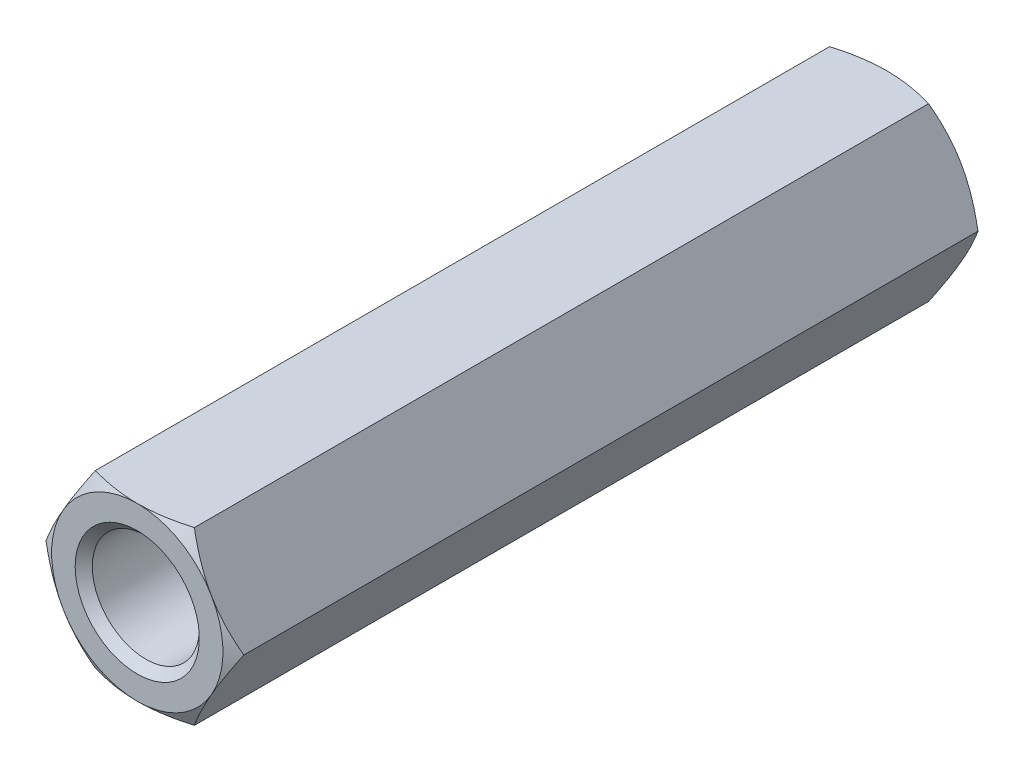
from build123d import *

# Parameters (mm, degrees)
BOSS_EXTRUDE1_DEPTH      = 17.5
SKETCH2_OUTSIDE_W        = 83.182
SKETCH2_OUTSIDE_H        = 81.944
SKETCH2_OUTSIDE_R        = 4
CUT_EXTRUDE1_DEPTH       = 19.536001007
CUT_EXTRUDE1_DRAFT       = -60
SKETCH3_R                = 2.5
SKETCH3_R_2              = 2.1
CUT_EXTRUDE2_DEPTH       = 10
SKETCH3_2_R              = 2.1
CUT_EXTRUDE3_DEPTH       = 11.2
CHAMFER1_SIZE            = 0.4
MIRROR1_COPY_1_SKETCH_W  = 83.182
MIRROR1_COPY_1_SKETCH_H  = 81.944
MIRROR1_COPY_1_SKETCH_R  = 4
MIRROR1_COPY_1_DEPTH     = 19.536001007
MIRROR1_COPY_1_DRAFT     = -60
CHAMFER1_OF_MIRROR1_SIZE = 0.4


with BuildPart() as part:
    # Sketch1 → Boss-Extrude1 (new body)
    with BuildSketch(Plane.XY):
        Polygon((2.309401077, 4), (-2.309401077, 4), (-4.618802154, 0), (-2.309401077, -4), (2.309401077, -4), (4.618802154, 0), align=None)
    boss_extrude1 = extrude(amount=-BOSS_EXTRUDE1_DEPTH)


with BuildPart() as cut_extrude1_tool:
    # Sketch2 outside → Cut-Extrude1 (with draft: the straight prism first)
    with BuildSketch(Plane(origin=(0, 0, -17.5), x_dir=(-1, 0, 0), z_dir=(0, 0, -1))):
        Rectangle(SKETCH2_OUTSIDE_W, SKETCH2_OUTSIDE_H)
        Circle(SKETCH2_OUTSIDE_R, mode=Mode.SUBTRACT)
    extrude(amount=-CUT_EXTRUDE1_DEPTH)
    # Cut-Extrude1: the draft: its side faces are tilted about the plane it starts from
    cut_extrude1_sides = [cut_extrude1_tool.faces().sort_by_distance(p)[0] for p in [
        (0, -40.972, -7.731999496),
        (-41.591, 0, -7.731999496),
        (0, 40.972, -7.731999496),
        (41.591, 0, -7.731999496),
        (4, 0, -7.731999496),
    ]]
    draft(cut_extrude1_sides, Plane(origin=(0, 0, -17.5), x_dir=(-1, 0, 0), z_dir=(0, 0, -1)), CUT_EXTRUDE1_DRAFT)


with BuildPart() as part_1:
    add(part.part)

    # Cut-Extrude1: cut by cut_extrude1_tool
    add(cut_extrude1_tool.part, mode=Mode.SUBTRACT)

    # Sketch3 → Cut-Extrude2 (cut)
    with BuildSketch(Plane(origin=(0, 0, -17.5), x_dir=(-1, 0, 0), z_dir=(0, 0, -1))):
        Circle(SKETCH3_R)
        Circle(SKETCH3_R_2, mode=Mode.SUBTRACT)
    cut_extrude2 = extrude(amount=-CUT_EXTRUDE2_DEPTH, mode=Mode.SUBTRACT)

    # Sketch3_2 → Cut-Extrude3 (cut)
    with BuildSketch(Plane(origin=(0, 0, -17.5), x_dir=(-1, 0, 0), z_dir=(0, 0, -1))):
        Circle(SKETCH3_2_R)
    cut_extrude3 = extrude(amount=-CUT_EXTRUDE3_DEPTH, mode=Mode.SUBTRACT)

    # Cut-Extrude4 cone 1 section (on through the dimple's axis) → Cut-Extrude4 (revolve, cut)
    with BuildSketch(Plane(origin=(0, 0, -6.3), x_dir=(0, 1, 0), z_dir=(1, 0, 0))):
        Polygon((0, 0), (2.1, 0), (0, 1.212435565), align=None)
    revolve(axis=Axis((0, 0, -6.3), (0, 0, 1)), mode=Mode.SUBTRACT)

    # Chamfer1
    chamfer1_edges = [part_1.edges().sort_by_distance(p)[0] for p in [
        (2.5, 0, -17.5),
    ]]
    chamfer(chamfer1_edges, length=CHAMFER1_SIZE)

    # Mirror1: Boss-Extrude1, Cut-Extrude2, Cut-Extrude3 across plane
    add(boss_extrude1.mirror(Plane.XY))
    add(cut_extrude2.mirror(Plane.XY), mode=Mode.SUBTRACT)
    add(cut_extrude3.mirror(Plane.XY), mode=Mode.SUBTRACT)


with BuildPart() as mirror1_copy_1_tool:
    # Mirror1 copy 1 sketch → Mirror1 copy 1 (with draft: the straight prism first)
    with BuildSketch(Plane(origin=(0, 0, 17.5), x_dir=(-1, 0, 0), z_dir=(0, 0, 1))):
        Rectangle(MIRROR1_COPY_1_SKETCH_W, MIRROR1_COPY_1_SKETCH_H)
        Circle(MIRROR1_COPY_1_SKETCH_R, mode=Mode.SUBTRACT)
    extrude(amount=-MIRROR1_COPY_1_DEPTH)
    # Mirror1 copy 1: the draft: its side faces are tilted about the plane it starts from
    mirror1_copy_1_sides = [mirror1_copy_1_tool.faces().sort_by_distance(p)[0] for p in [
        (0, -40.972, 7.731999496),
        (-41.591, 0, 7.731999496),
        (0, 40.972, 7.731999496),
        (41.591, 0, 7.731999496),
        (4, 0, 7.731999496),
    ]]
    draft(mirror1_copy_1_sides, Plane(origin=(0, 0, 17.5), x_dir=(-1, 0, 0), z_dir=(0, 0, 1)), MIRROR1_COPY_1_DRAFT)


with BuildPart() as part_2:
    add(part_1.part)

    # Mirror1 copy 1: cut by mirror1_copy_1_tool
    add(mirror1_copy_1_tool.part, mode=Mode.SUBTRACT)

    # Chamfer1 of Mirror1
    chamfer1_of_mirror1_edges = [part_2.edges().sort_by_distance(p)[0] for p in [
        (2.5, 0, 17.5),
    ]]
    chamfer(chamfer1_of_mirror1_edges, length=CHAMFER1_OF_MIRROR1_SIZE)


solid = part_2.part
